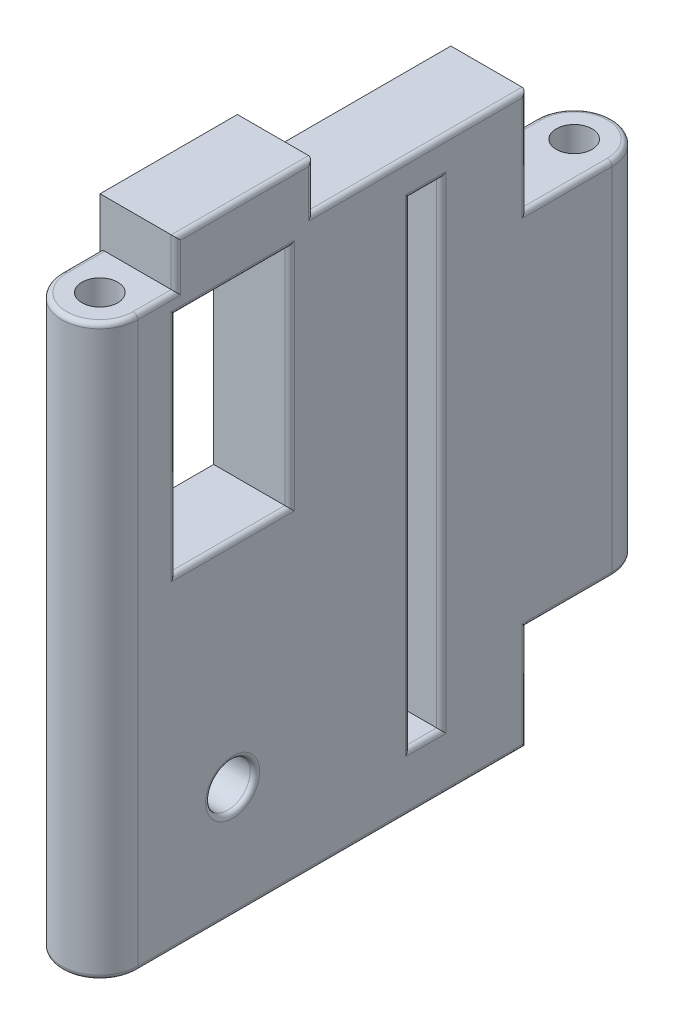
ISO-10303-21;
HEADER;
FILE_DESCRIPTION(('STEP AP214'),'2;1');
FILE_NAME('part.step','',(''),(''),'','','');
FILE_SCHEMA(('AUTOMOTIVE_DESIGN { 1 0 10303 214 1 1 1 1 }'));
ENDSEC;
DATA;
#1=APPLICATION_CONTEXT('core data for automotive mechanical design processes');
#2=APPLICATION_PROTOCOL_DEFINITION('international standard','automotive_design',2000,#1);
#3=PRODUCT_CONTEXT('',#1,'mechanical');
#4=PRODUCT('Part','Part','',(#3));
#5=PRODUCT_RELATED_PRODUCT_CATEGORY('part','',(#4));
#6=PRODUCT_DEFINITION_FORMATION('','',#4);
#7=PRODUCT_DEFINITION_CONTEXT('part definition',#1,'design');
#8=PRODUCT_DEFINITION('design','',#6,#7);
#9=PRODUCT_DEFINITION_SHAPE('','',#8);
#10=(LENGTH_UNIT() NAMED_UNIT(*) SI_UNIT(.MILLI.,.METRE.));
#11=(NAMED_UNIT(*) PLANE_ANGLE_UNIT() SI_UNIT($,.RADIAN.));
#12=(NAMED_UNIT(*) SI_UNIT($,.STERADIAN.) SOLID_ANGLE_UNIT());
#13=UNCERTAINTY_MEASURE_WITH_UNIT(LENGTH_MEASURE(1.E-05),#10,'distance_accuracy_value','');
#14=(GEOMETRIC_REPRESENTATION_CONTEXT(3) GLOBAL_UNCERTAINTY_ASSIGNED_CONTEXT((#13)) GLOBAL_UNIT_ASSIGNED_CONTEXT((#10,
#11,#12)) REPRESENTATION_CONTEXT('',''));
#15=CARTESIAN_POINT('',(0.,0.,0.));
#16=DIRECTION('',(0.,0.,1.));
#17=DIRECTION('',(1.,0.,0.));
#18=AXIS2_PLACEMENT_3D('',#15,#16,#17);
#19=CARTESIAN_POINT('',(0.,60.,0.));
#20=DIRECTION('',(0.,1.,0.));
#21=DIRECTION('',(0.,0.,1.));
#22=AXIS2_PLACEMENT_3D('',#19,#20,#21);
#23=PLANE('',#22);
#24=DIRECTION('',(1.,0.,0.));
#25=VECTOR('',#24,1.);
#26=CARTESIAN_POINT('',(-4.,60.,45.9755050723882));
#27=LINE('',#26,#25);
#28=CARTESIAN_POINT('',(-3.49999999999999,60.,45.9755050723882));
#29=VERTEX_POINT('',#28);
#30=CARTESIAN_POINT('',(3.5,60.,45.9755050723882));
#31=VERTEX_POINT('',#30);
#32=EDGE_CURVE('E297',#29,#31,#27,.T.);
#33=ORIENTED_EDGE('',*,*,#32,.F.);
#34=DIRECTION('',(0.,0.,1.));
#35=VECTOR('',#34,1.);
#36=CARTESIAN_POINT('',(-3.49999999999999,60.,50.));
#37=LINE('',#36,#35);
#38=CARTESIAN_POINT('',(-3.49999999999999,60.,50.));
#39=VERTEX_POINT('',#38);
#40=EDGE_CURVE('E620',#29,#39,#37,.T.);
#41=ORIENTED_EDGE('',*,*,#40,.T.);
#42=CARTESIAN_POINT('',(0.,60.,50.));
#43=DIRECTION('',(0.,1.,0.));
#44=DIRECTION('',(0.,0.,1.));
#45=AXIS2_PLACEMENT_3D('',#42,#43,#44);
#46=CIRCLE('',#45,3.5);
#47=CARTESIAN_POINT('',(3.50000000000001,60.,50.));
#48=VERTEX_POINT('',#47);
#49=EDGE_CURVE('E623',#39,#48,#46,.T.);
#50=ORIENTED_EDGE('',*,*,#49,.T.);
#51=DIRECTION('',(0.,0.,-1.));
#52=VECTOR('',#51,1.);
#53=CARTESIAN_POINT('',(3.5,60.,45.9755050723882));
#54=LINE('',#53,#52);
#55=EDGE_CURVE('E625',#48,#31,#54,.T.);
#56=ORIENTED_EDGE('',*,*,#55,.T.);
#57=EDGE_LOOP('',(#33,#41,#50,#56));
#58=FACE_BOUND('',#57,.T.);
#59=CARTESIAN_POINT('',(0.,60.,50.));
#60=DIRECTION('',(0.,-1.,0.));
#61=DIRECTION('',(0.,0.,-1.));
#62=AXIS2_PLACEMENT_3D('',#59,#60,#61);
#63=CIRCLE('',#62,1.8875);
#64=CARTESIAN_POINT('',(0.,60.,48.1125));
#65=VERTEX_POINT('',#64);
#66=EDGE_CURVE('E1126',#65,#65,#63,.T.);
#67=ORIENTED_EDGE('',*,*,#66,.T.);
#68=EDGE_LOOP('',(#67));
#69=FACE_BOUND('',#68,.T.);
#70=ADVANCED_FACE('F38',(#58,#69),#23,.T.);
#71=CARTESIAN_POINT('',(0.,60.,0.));
#72=DIRECTION('',(0.,-1.,0.));
#73=DIRECTION('',(0.,0.,-1.));
#74=AXIS2_PLACEMENT_3D('',#71,#72,#73);
#75=CYLINDRICAL_SURFACE('',#74,4.);
#76=DIRECTION('',(0.,-1.,0.));
#77=VECTOR('',#76,1.);
#78=CARTESIAN_POINT('',(-4.,60.,0.));
#79=LINE('',#78,#77);
#80=CARTESIAN_POINT('',(-4.,48.5,0.));
#81=VERTEX_POINT('',#80);
#82=CARTESIAN_POINT('',(-4.,11.5,0.));
#83=VERTEX_POINT('',#82);
#84=EDGE_CURVE('E509',#81,#83,#79,.T.);
#85=ORIENTED_EDGE('',*,*,#84,.F.);
#86=CARTESIAN_POINT('',(0.,48.5,0.));
#87=DIRECTION('',(0.,-1.,0.));
#88=DIRECTION('',(0.,0.,-1.));
#89=AXIS2_PLACEMENT_3D('',#86,#87,#88);
#90=CIRCLE('',#89,4.);
#91=CARTESIAN_POINT('',(4.,48.5,0.));
#92=VERTEX_POINT('',#91);
#93=EDGE_CURVE('E534',#81,#92,#90,.T.);
#94=ORIENTED_EDGE('',*,*,#93,.T.);
#95=DIRECTION('',(0.,-1.,0.));
#96=VECTOR('',#95,1.);
#97=CARTESIAN_POINT('',(4.,60.,0.));
#98=LINE('',#97,#96);
#99=CARTESIAN_POINT('',(4.,11.5,0.));
#100=VERTEX_POINT('',#99);
#101=EDGE_CURVE('E638',#92,#100,#98,.T.);
#102=ORIENTED_EDGE('',*,*,#101,.T.);
#103=CARTESIAN_POINT('',(0.,11.5,0.));
#104=DIRECTION('',(0.,1.,0.));
#105=DIRECTION('',(0.,0.,1.));
#106=AXIS2_PLACEMENT_3D('',#103,#104,#105);
#107=CIRCLE('',#106,4.);
#108=EDGE_CURVE('E532',#100,#83,#107,.T.);
#109=ORIENTED_EDGE('',*,*,#108,.T.);
#110=EDGE_LOOP('',(#85,#94,#102,#109));
#111=FACE_BOUND('',#110,.T.);
#112=ADVANCED_FACE('F569',(#111),#75,.T.);
#113=CARTESIAN_POINT('',(-4.,60.,0.));
#114=DIRECTION('',(1.,0.,0.));
#115=DIRECTION('',(0.,0.,-1.));
#116=AXIS2_PLACEMENT_3D('',#113,#114,#115);
#117=PLANE('',#116);
#118=DIRECTION('',(0.,0.,1.));
#119=VECTOR('',#118,1.);
#120=CARTESIAN_POINT('',(-4.,6.,18.));
#121=LINE('',#120,#119);
#122=CARTESIAN_POINT('',(-4.,6.,18.));
#123=VERTEX_POINT('',#122);
#124=CARTESIAN_POINT('',(-4.,6.,21.3));
#125=VERTEX_POINT('',#124);
#126=EDGE_CURVE('E274',#123,#125,#121,.T.);
#127=ORIENTED_EDGE('',*,*,#126,.F.);
#128=DIRECTION('',(0.,-1.,0.));
#129=VECTOR('',#128,1.);
#130=CARTESIAN_POINT('',(-4.,56.3,18.));
#131=LINE('',#130,#129);
#132=CARTESIAN_POINT('',(-4.,56.3,18.));
#133=VERTEX_POINT('',#132);
#134=EDGE_CURVE('E279',#133,#123,#131,.T.);
#135=ORIENTED_EDGE('',*,*,#134,.F.);
#136=DIRECTION('',(0.,0.,-1.));
#137=VECTOR('',#136,1.);
#138=CARTESIAN_POINT('',(-4.,56.3,18.));
#139=LINE('',#138,#137);
#140=CARTESIAN_POINT('',(-4.,56.3,21.3));
#141=VERTEX_POINT('',#140);
#142=EDGE_CURVE('E284',#141,#133,#139,.T.);
#143=ORIENTED_EDGE('',*,*,#142,.F.);
#144=DIRECTION('',(0.,1.,0.));
#145=VECTOR('',#144,1.);
#146=CARTESIAN_POINT('',(-4.,56.3,21.3));
#147=LINE('',#146,#145);
#148=EDGE_CURVE('E266',#125,#141,#147,.T.);
#149=ORIENTED_EDGE('',*,*,#148,.F.);
#150=EDGE_LOOP('',(#127,#135,#143,#149));
#151=FACE_BOUND('',#150,.T.);
#152=CARTESIAN_POINT('',(-4.,11.8464,40.));
#153=DIRECTION('',(-1.,0.,0.));
#154=DIRECTION('',(0.,0.,1.));
#155=AXIS2_PLACEMENT_3D('',#152,#153,#154);
#156=CIRCLE('',#155,2.35);
#157=CARTESIAN_POINT('',(-4.,11.8464,42.35));
#158=VERTEX_POINT('',#157);
#159=EDGE_CURVE('E1129',#158,#158,#156,.T.);
#160=ORIENTED_EDGE('',*,*,#159,.F.);
#161=EDGE_LOOP('',(#160));
#162=FACE_BOUND('',#161,.T.);
#163=DIRECTION('',(0.,0.,1.));
#164=VECTOR('',#163,1.);
#165=CARTESIAN_POINT('',(-4.,34.3,34.));
#166=LINE('',#165,#164);
#167=CARTESIAN_POINT('',(-4.,34.3,34.));
#168=VERTEX_POINT('',#167);
#169=CARTESIAN_POINT('',(-4.,34.3,46.));
#170=VERTEX_POINT('',#169);
#171=EDGE_CURVE('E1138',#168,#170,#166,.T.);
#172=ORIENTED_EDGE('',*,*,#171,.F.);
#173=DIRECTION('',(0.,-1.,0.));
#174=VECTOR('',#173,1.);
#175=CARTESIAN_POINT('',(-4.,34.3,34.));
#176=LINE('',#175,#174);
#177=CARTESIAN_POINT('',(-4.,58.,34.));
#178=VERTEX_POINT('',#177);
#179=EDGE_CURVE('E1135',#178,#168,#176,.T.);
#180=ORIENTED_EDGE('',*,*,#179,.F.);
#181=DIRECTION('',(0.,0.,-1.));
#182=VECTOR('',#181,1.);
#183=CARTESIAN_POINT('',(-4.,58.,34.));
#184=LINE('',#183,#182);
#185=CARTESIAN_POINT('',(-4.,58.,46.));
#186=VERTEX_POINT('',#185);
#187=EDGE_CURVE('E1144',#186,#178,#184,.T.);
#188=ORIENTED_EDGE('',*,*,#187,.F.);
#189=DIRECTION('',(0.,1.,0.));
#190=VECTOR('',#189,1.);
#191=CARTESIAN_POINT('',(-4.,34.3,46.));
#192=LINE('',#191,#190);
#193=EDGE_CURVE('E1141',#170,#186,#192,.T.);
#194=ORIENTED_EDGE('',*,*,#193,.F.);
#195=EDGE_LOOP('',(#172,#180,#188,#194));
#196=FACE_BOUND('',#195,.T.);
#197=DIRECTION('',(0.,-1.,0.));
#198=VECTOR('',#197,1.);
#199=CARTESIAN_POINT('',(-3.99999999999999,60.,50.));
#200=LINE('',#199,#198);
#201=CARTESIAN_POINT('',(-3.99999999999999,59.5,50.));
#202=VERTEX_POINT('',#201);
#203=CARTESIAN_POINT('',(-3.99999999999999,0.5,50.));
#204=VERTEX_POINT('',#203);
#205=EDGE_CURVE('E649',#202,#204,#200,.T.);
#206=ORIENTED_EDGE('',*,*,#205,.F.);
#207=DIRECTION('',(0.,0.,1.));
#208=VECTOR('',#207,1.);
#209=CARTESIAN_POINT('',(-3.99999999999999,59.5,45.9755050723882));
#210=LINE('',#209,#208);
#211=CARTESIAN_POINT('',(-4.,59.5,45.9755050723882));
#212=VERTEX_POINT('',#211);
#213=EDGE_CURVE('E609',#202,#212,#210,.F.);
#214=ORIENTED_EDGE('',*,*,#213,.T.);
#215=DIRECTION('',(0.,-1.,0.));
#216=VECTOR('',#215,1.);
#217=CARTESIAN_POINT('',(-4.,65.,45.9755050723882));
#218=LINE('',#217,#216);
#219=CARTESIAN_POINT('',(-4.,65.,45.9755050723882));
#220=VERTEX_POINT('',#219);
#221=EDGE_CURVE('E302',#220,#212,#218,.T.);
#222=ORIENTED_EDGE('',*,*,#221,.F.);
#223=DIRECTION('',(0.,0.,1.));
#224=VECTOR('',#223,1.);
#225=CARTESIAN_POINT('',(-4.,65.,31.5));
#226=LINE('',#225,#224);
#227=CARTESIAN_POINT('',(-4.,65.,31.5));
#228=VERTEX_POINT('',#227);
#229=EDGE_CURVE('E296',#228,#220,#226,.T.);
#230=ORIENTED_EDGE('',*,*,#229,.F.);
#231=DIRECTION('',(0.,-1.,0.));
#232=VECTOR('',#231,1.);
#233=CARTESIAN_POINT('',(-4.,65.,31.5));
#234=LINE('',#233,#232);
#235=CARTESIAN_POINT('',(-4.,60.,31.5));
#236=VERTEX_POINT('',#235);
#237=EDGE_CURVE('E476',#228,#236,#234,.T.);
#238=ORIENTED_EDGE('',*,*,#237,.T.);
#239=DIRECTION('',(0.,0.,1.));
#240=VECTOR('',#239,1.);
#241=CARTESIAN_POINT('',(-4.,60.,0.));
#242=LINE('',#241,#240);
#243=CARTESIAN_POINT('',(-4.,60.,8.99999999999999));
#244=VERTEX_POINT('',#243);
#245=EDGE_CURVE('E635',#244,#236,#242,.T.);
#246=ORIENTED_EDGE('',*,*,#245,.F.);
#247=DIRECTION('',(0.,1.,0.));
#248=VECTOR('',#247,1.);
#249=CARTESIAN_POINT('',(-4.,49.,8.99999999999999));
#250=LINE('',#249,#248);
#251=CARTESIAN_POINT('',(-4.,48.5,8.99999999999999));
#252=VERTEX_POINT('',#251);
#253=EDGE_CURVE('E507',#252,#244,#250,.T.);
#254=ORIENTED_EDGE('',*,*,#253,.F.);
#255=DIRECTION('',(0.,0.,1.));
#256=VECTOR('',#255,1.);
#257=CARTESIAN_POINT('',(-4.,48.5,0.));
#258=LINE('',#257,#256);
#259=EDGE_CURVE('E611',#252,#81,#258,.F.);
#260=ORIENTED_EDGE('',*,*,#259,.T.);
#261=ORIENTED_EDGE('',*,*,#84,.T.);
#262=DIRECTION('',(0.,0.,-1.));
#263=VECTOR('',#262,1.);
#264=CARTESIAN_POINT('',(-4.,11.5,0.));
#265=LINE('',#264,#263);
#266=CARTESIAN_POINT('',(-4.,11.5,9.));
#267=VERTEX_POINT('',#266);
#268=EDGE_CURVE('E615',#83,#267,#265,.F.);
#269=ORIENTED_EDGE('',*,*,#268,.T.);
#270=DIRECTION('',(0.,1.,0.));
#271=VECTOR('',#270,1.);
#272=CARTESIAN_POINT('',(-4.,11.,9.));
#273=LINE('',#272,#271);
#274=CARTESIAN_POINT('',(-4.,0.5,9.));
#275=VERTEX_POINT('',#274);
#276=EDGE_CURVE('E682',#275,#267,#273,.T.);
#277=ORIENTED_EDGE('',*,*,#276,.F.);
#278=DIRECTION('',(0.,0.,1.));
#279=VECTOR('',#278,1.);
#280=CARTESIAN_POINT('',(-4.,0.5,0.));
#281=LINE('',#280,#279);
#282=EDGE_CURVE('E618',#275,#204,#281,.T.);
#283=ORIENTED_EDGE('',*,*,#282,.T.);
#284=EDGE_LOOP('',(#206,#214,#222,#230,#238,#246,#254,#260,#261,#269,#277,#283));
#285=FACE_BOUND('',#284,.T.);
#286=ADVANCED_FACE('F281',(#151,#162,#196,#285),#117,.F.);
#287=CARTESIAN_POINT('',(0.,60.,50.));
#288=DIRECTION('',(0.,-1.,0.));
#289=DIRECTION('',(0.,0.,-1.));
#290=AXIS2_PLACEMENT_3D('',#287,#288,#289);
#291=CYLINDRICAL_SURFACE('',#290,4.);
#292=DIRECTION('',(0.,-1.,0.));
#293=VECTOR('',#292,1.);
#294=CARTESIAN_POINT('',(4.00000000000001,60.,50.));
#295=LINE('',#294,#293);
#296=CARTESIAN_POINT('',(4.00000000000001,59.5,50.));
#297=VERTEX_POINT('',#296);
#298=CARTESIAN_POINT('',(4.00000000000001,0.5,50.));
#299=VERTEX_POINT('',#298);
#300=EDGE_CURVE('E647',#297,#299,#295,.T.);
#301=ORIENTED_EDGE('',*,*,#300,.F.);
#302=CARTESIAN_POINT('',(0.,59.5,50.));
#303=DIRECTION('',(0.,1.,0.));
#304=DIRECTION('',(0.,0.,1.));
#305=AXIS2_PLACEMENT_3D('',#302,#303,#304);
#306=CIRCLE('',#305,4.);
#307=EDGE_CURVE('E523',#297,#202,#306,.F.);
#308=ORIENTED_EDGE('',*,*,#307,.T.);
#309=ORIENTED_EDGE('',*,*,#205,.T.);
#310=CARTESIAN_POINT('',(0.,0.5,50.));
#311=DIRECTION('',(0.,1.,0.));
#312=DIRECTION('',(0.,0.,1.));
#313=AXIS2_PLACEMENT_3D('',#310,#311,#312);
#314=CIRCLE('',#313,4.);
#315=EDGE_CURVE('E527',#204,#299,#314,.T.);
#316=ORIENTED_EDGE('',*,*,#315,.T.);
#317=EDGE_LOOP('',(#301,#308,#309,#316));
#318=FACE_BOUND('',#317,.T.);
#319=ADVANCED_FACE('F555',(#318),#291,.T.);
#320=CARTESIAN_POINT('',(4.,60.,0.));
#321=DIRECTION('',(-1.,0.,0.));
#322=DIRECTION('',(0.,0.,1.));
#323=AXIS2_PLACEMENT_3D('',#320,#321,#322);
#324=PLANE('',#323);
#325=DIRECTION('',(0.,0.,1.));
#326=VECTOR('',#325,1.);
#327=CARTESIAN_POINT('',(4.,33.8,0.));
#328=LINE('',#327,#326);
#329=CARTESIAN_POINT('',(4.,33.8,33.5));
#330=VERTEX_POINT('',#329);
#331=CARTESIAN_POINT('',(4.00000000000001,33.8,46.5));
#332=VERTEX_POINT('',#331);
#333=EDGE_CURVE('E435',#330,#332,#328,.T.);
#334=ORIENTED_EDGE('',*,*,#333,.T.);
#335=DIRECTION('',(0.,1.,0.));
#336=VECTOR('',#335,1.);
#337=CARTESIAN_POINT('',(4.00000000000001,60.,46.5));
#338=LINE('',#337,#336);
#339=CARTESIAN_POINT('',(4.00000000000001,58.5,46.5));
#340=VERTEX_POINT('',#339);
#341=EDGE_CURVE('E437',#332,#340,#338,.T.);
#342=ORIENTED_EDGE('',*,*,#341,.T.);
#343=DIRECTION('',(0.,0.,-1.));
#344=VECTOR('',#343,1.);
#345=CARTESIAN_POINT('',(4.,58.5,0.));
#346=LINE('',#345,#344);
#347=CARTESIAN_POINT('',(4.,58.5,33.5));
#348=VERTEX_POINT('',#347);
#349=EDGE_CURVE('E427',#340,#348,#346,.T.);
#350=ORIENTED_EDGE('',*,*,#349,.T.);
#351=DIRECTION('',(0.,-1.,0.));
#352=VECTOR('',#351,1.);
#353=CARTESIAN_POINT('',(4.,60.,33.5));
#354=LINE('',#353,#352);
#355=EDGE_CURVE('E433',#348,#330,#354,.T.);
#356=ORIENTED_EDGE('',*,*,#355,.T.);
#357=EDGE_LOOP('',(#334,#342,#350,#356));
#358=FACE_BOUND('',#357,.T.);
#359=CARTESIAN_POINT('',(4.,11.8464,40.));
#360=DIRECTION('',(-1.,0.,0.));
#361=DIRECTION('',(0.,0.,1.));
#362=AXIS2_PLACEMENT_3D('',#359,#360,#361);
#363=CIRCLE('',#362,2.85);
#364=CARTESIAN_POINT('',(4.,11.8464,42.85));
#365=VERTEX_POINT('',#364);
#366=EDGE_CURVE('E424',#365,#365,#363,.T.);
#367=ORIENTED_EDGE('',*,*,#366,.T.);
#368=EDGE_LOOP('',(#367));
#369=FACE_BOUND('',#368,.T.);
#370=DIRECTION('',(0.,0.,1.));
#371=VECTOR('',#370,1.);
#372=CARTESIAN_POINT('',(4.,5.5,0.));
#373=LINE('',#372,#371);
#374=CARTESIAN_POINT('',(4.,5.5,17.5));
#375=VERTEX_POINT('',#374);
#376=CARTESIAN_POINT('',(4.,5.5,21.8));
#377=VERTEX_POINT('',#376);
#378=EDGE_CURVE('E410',#375,#377,#373,.T.);
#379=ORIENTED_EDGE('',*,*,#378,.T.);
#380=DIRECTION('',(0.,1.,0.));
#381=VECTOR('',#380,1.);
#382=CARTESIAN_POINT('',(4.,60.,21.8));
#383=LINE('',#382,#381);
#384=CARTESIAN_POINT('',(4.,56.8,21.8));
#385=VERTEX_POINT('',#384);
#386=EDGE_CURVE('E422',#377,#385,#383,.T.);
#387=ORIENTED_EDGE('',*,*,#386,.T.);
#388=DIRECTION('',(0.,0.,-1.));
#389=VECTOR('',#388,1.);
#390=CARTESIAN_POINT('',(4.,56.8,0.));
#391=LINE('',#390,#389);
#392=CARTESIAN_POINT('',(4.,56.8,17.5));
#393=VERTEX_POINT('',#392);
#394=EDGE_CURVE('E553',#385,#393,#391,.T.);
#395=ORIENTED_EDGE('',*,*,#394,.T.);
#396=DIRECTION('',(0.,-1.,0.));
#397=VECTOR('',#396,1.);
#398=CARTESIAN_POINT('',(4.,60.,17.5));
#399=LINE('',#398,#397);
#400=EDGE_CURVE('E413',#393,#375,#399,.T.);
#401=ORIENTED_EDGE('',*,*,#400,.T.);
#402=EDGE_LOOP('',(#379,#387,#395,#401));
#403=FACE_BOUND('',#402,.T.);
#404=DIRECTION('',(0.,-1.,0.));
#405=VECTOR('',#404,1.);
#406=CARTESIAN_POINT('',(4.,60.,45.4755050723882));
#407=LINE('',#406,#405);
#408=CARTESIAN_POINT('',(4.,64.5,45.4755050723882));
#409=VERTEX_POINT('',#408);
#410=CARTESIAN_POINT('',(4.,59.5,45.4755050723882));
#411=VERTEX_POINT('',#410);
#412=EDGE_CURVE('E456',#409,#411,#407,.T.);
#413=ORIENTED_EDGE('',*,*,#412,.T.);
#414=DIRECTION('',(0.,0.,-1.));
#415=VECTOR('',#414,1.);
#416=CARTESIAN_POINT('',(4.00000000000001,59.5,50.));
#417=LINE('',#416,#415);
#418=EDGE_CURVE('E458',#411,#297,#417,.F.);
#419=ORIENTED_EDGE('',*,*,#418,.T.);
#420=ORIENTED_EDGE('',*,*,#300,.T.);
#421=DIRECTION('',(0.,0.,-1.));
#422=VECTOR('',#421,1.);
#423=CARTESIAN_POINT('',(4.,0.5,0.));
#424=LINE('',#423,#422);
#425=CARTESIAN_POINT('',(4.,0.5,9.5));
#426=VERTEX_POINT('',#425);
#427=EDGE_CURVE('E440',#299,#426,#424,.T.);
#428=ORIENTED_EDGE('',*,*,#427,.T.);
#429=DIRECTION('',(0.,1.,0.));
#430=VECTOR('',#429,1.);
#431=CARTESIAN_POINT('',(4.,60.,9.49999999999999));
#432=LINE('',#431,#430);
#433=CARTESIAN_POINT('',(4.,11.5,9.5));
#434=VERTEX_POINT('',#433);
#435=EDGE_CURVE('E442',#426,#434,#432,.T.);
#436=ORIENTED_EDGE('',*,*,#435,.T.);
#437=DIRECTION('',(0.,0.,-1.));
#438=VECTOR('',#437,1.);
#439=CARTESIAN_POINT('',(4.,11.5,0.));
#440=LINE('',#439,#438);
#441=EDGE_CURVE('E444',#434,#100,#440,.T.);
#442=ORIENTED_EDGE('',*,*,#441,.T.);
#443=ORIENTED_EDGE('',*,*,#101,.F.);
#444=DIRECTION('',(0.,0.,1.));
#445=VECTOR('',#444,1.);
#446=CARTESIAN_POINT('',(4.,48.5,0.));
#447=LINE('',#446,#445);
#448=CARTESIAN_POINT('',(4.,48.5,9.49999999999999));
#449=VERTEX_POINT('',#448);
#450=EDGE_CURVE('E446',#92,#449,#447,.T.);
#451=ORIENTED_EDGE('',*,*,#450,.T.);
#452=DIRECTION('',(0.,1.,0.));
#453=VECTOR('',#452,1.);
#454=CARTESIAN_POINT('',(4.,60.,9.49999999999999));
#455=LINE('',#454,#453);
#456=CARTESIAN_POINT('',(4.,59.5,9.49999999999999));
#457=VERTEX_POINT('',#456);
#458=EDGE_CURVE('E448',#449,#457,#455,.T.);
#459=ORIENTED_EDGE('',*,*,#458,.T.);
#460=DIRECTION('',(0.,0.,-1.));
#461=VECTOR('',#460,1.);
#462=CARTESIAN_POINT('',(4.,59.5,31.5));
#463=LINE('',#462,#461);
#464=CARTESIAN_POINT('',(4.,59.5,32.));
#465=VERTEX_POINT('',#464);
#466=EDGE_CURVE('E450',#457,#465,#463,.F.);
#467=ORIENTED_EDGE('',*,*,#466,.T.);
#468=DIRECTION('',(0.,-1.,0.));
#469=VECTOR('',#468,1.);
#470=CARTESIAN_POINT('',(4.,60.,32.));
#471=LINE('',#470,#469);
#472=CARTESIAN_POINT('',(4.,64.5,32.));
#473=VERTEX_POINT('',#472);
#474=EDGE_CURVE('E452',#465,#473,#471,.F.);
#475=ORIENTED_EDGE('',*,*,#474,.T.);
#476=DIRECTION('',(0.,0.,-1.));
#477=VECTOR('',#476,1.);
#478=CARTESIAN_POINT('',(4.00000000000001,64.5,45.9755050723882));
#479=LINE('',#478,#477);
#480=EDGE_CURVE('E454',#473,#409,#479,.F.);
#481=ORIENTED_EDGE('',*,*,#480,.T.);
#482=EDGE_LOOP('',(#413,#419,#420,#428,#436,#442,#443,#451,#459,#467,#475,#481));
#483=FACE_BOUND('',#482,.T.);
#484=ADVANCED_FACE('F487',(#358,#369,#403,#483),#324,.F.);
#485=DIRECTION('',(-1.,0.,0.));
#486=VECTOR('',#485,1.);
#487=CARTESIAN_POINT('',(4.,60.,31.5));
#488=LINE('',#487,#486);
#489=CARTESIAN_POINT('',(3.5,60.,31.5));
#490=VERTEX_POINT('',#489);
#491=EDGE_CURVE('E291',#490,#236,#488,.T.);
#492=ORIENTED_EDGE('',*,*,#491,.F.);
#493=DIRECTION('',(0.,0.,-1.));
#494=VECTOR('',#493,1.);
#495=CARTESIAN_POINT('',(3.5,60.,8.99999999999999));
#496=LINE('',#495,#494);
#497=CARTESIAN_POINT('',(3.5,60.,8.99999999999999));
#498=VERTEX_POINT('',#497);
#499=EDGE_CURVE('E314',#490,#498,#496,.T.);
#500=ORIENTED_EDGE('',*,*,#499,.T.);
#501=DIRECTION('',(1.,0.,0.));
#502=VECTOR('',#501,1.);
#503=CARTESIAN_POINT('',(0.,60.,8.99999999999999));
#504=LINE('',#503,#502);
#505=EDGE_CURVE('E500',#244,#498,#504,.T.);
#506=ORIENTED_EDGE('',*,*,#505,.F.);
#507=ORIENTED_EDGE('',*,*,#245,.T.);
#508=EDGE_LOOP('',(#492,#500,#506,#507));
#509=FACE_BOUND('',#508,.T.);
#510=ADVANCED_FACE('F498',(#509),#23,.T.);
#511=CARTESIAN_POINT('',(0.,0.,0.));
#512=DIRECTION('',(0.,1.,0.));
#513=DIRECTION('',(0.,0.,1.));
#514=AXIS2_PLACEMENT_3D('',#511,#512,#513);
#515=PLANE('',#514);
#516=CARTESIAN_POINT('',(0.,0.,50.));
#517=DIRECTION('',(0.,-1.,0.));
#518=DIRECTION('',(0.,0.,-1.));
#519=AXIS2_PLACEMENT_3D('',#516,#517,#518);
#520=CIRCLE('',#519,1.8875);
#521=CARTESIAN_POINT('',(0.,0.,48.1125));
#522=VERTEX_POINT('',#521);
#523=EDGE_CURVE('E590',#522,#522,#520,.T.);
#524=ORIENTED_EDGE('',*,*,#523,.F.);
#525=EDGE_LOOP('',(#524));
#526=FACE_BOUND('',#525,.T.);
#527=CARTESIAN_POINT('',(0.,0.,50.));
#528=DIRECTION('',(0.,1.,0.));
#529=DIRECTION('',(0.,0.,1.));
#530=AXIS2_PLACEMENT_3D('',#527,#528,#529);
#531=CIRCLE('',#530,3.5);
#532=CARTESIAN_POINT('',(3.50000000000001,0.,50.));
#533=VERTEX_POINT('',#532);
#534=CARTESIAN_POINT('',(-3.49999999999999,0.,50.));
#535=VERTEX_POINT('',#534);
#536=EDGE_CURVE('E545',#533,#535,#531,.F.);
#537=ORIENTED_EDGE('',*,*,#536,.T.);
#538=DIRECTION('',(0.,0.,1.));
#539=VECTOR('',#538,1.);
#540=CARTESIAN_POINT('',(-3.5,0.,0.));
#541=LINE('',#540,#539);
#542=CARTESIAN_POINT('',(-3.5,0.,9.));
#543=VERTEX_POINT('',#542);
#544=EDGE_CURVE('E547',#535,#543,#541,.F.);
#545=ORIENTED_EDGE('',*,*,#544,.T.);
#546=DIRECTION('',(1.,0.,0.));
#547=VECTOR('',#546,1.);
#548=CARTESIAN_POINT('',(0.,0.,9.));
#549=LINE('',#548,#547);
#550=CARTESIAN_POINT('',(3.5,0.,9.));
#551=VERTEX_POINT('',#550);
#552=EDGE_CURVE('E508',#543,#551,#549,.T.);
#553=ORIENTED_EDGE('',*,*,#552,.T.);
#554=DIRECTION('',(0.,0.,-1.));
#555=VECTOR('',#554,1.);
#556=CARTESIAN_POINT('',(3.5,0.,0.));
#557=LINE('',#556,#555);
#558=EDGE_CURVE('E543',#551,#533,#557,.F.);
#559=ORIENTED_EDGE('',*,*,#558,.T.);
#560=EDGE_LOOP('',(#537,#545,#553,#559));
#561=FACE_BOUND('',#560,.T.);
#562=ADVANCED_FACE('F562',(#526,#561),#515,.F.);
#563=CARTESIAN_POINT('',(46.,49.,-13.1258902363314));
#564=DIRECTION('',(0.,-1.,0.));
#565=DIRECTION('',(0.,0.,-1.));
#566=AXIS2_PLACEMENT_3D('',#563,#564,#565);
#567=PLANE('',#566);
#568=CARTESIAN_POINT('',(0.,49.,0.));
#569=DIRECTION('',(0.,-1.,0.));
#570=DIRECTION('',(0.,0.,-1.));
#571=AXIS2_PLACEMENT_3D('',#568,#569,#570);
#572=CIRCLE('',#571,1.8875);
#573=CARTESIAN_POINT('',(0.,49.,-1.8875));
#574=VERTEX_POINT('',#573);
#575=EDGE_CURVE('E1127',#574,#574,#572,.T.);
#576=ORIENTED_EDGE('',*,*,#575,.T.);
#577=EDGE_LOOP('',(#576));
#578=FACE_BOUND('',#577,.T.);
#579=CARTESIAN_POINT('',(0.,49.,0.));
#580=DIRECTION('',(0.,-1.,0.));
#581=DIRECTION('',(0.,0.,-1.));
#582=AXIS2_PLACEMENT_3D('',#579,#580,#581);
#583=CIRCLE('',#582,3.5);
#584=CARTESIAN_POINT('',(3.5,49.,0.));
#585=VERTEX_POINT('',#584);
#586=CARTESIAN_POINT('',(-3.5,49.,0.));
#587=VERTEX_POINT('',#586);
#588=EDGE_CURVE('E522',#585,#587,#583,.F.);
#589=ORIENTED_EDGE('',*,*,#588,.T.);
#590=DIRECTION('',(0.,0.,1.));
#591=VECTOR('',#590,1.);
#592=CARTESIAN_POINT('',(-3.5,49.,-13.1258902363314));
#593=LINE('',#592,#591);
#594=CARTESIAN_POINT('',(-3.5,49.,8.99999999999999));
#595=VERTEX_POINT('',#594);
#596=EDGE_CURVE('E525',#587,#595,#593,.T.);
#597=ORIENTED_EDGE('',*,*,#596,.T.);
#598=DIRECTION('',(-1.,0.,0.));
#599=VECTOR('',#598,1.);
#600=CARTESIAN_POINT('',(46.,49.,8.99999999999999));
#601=LINE('',#600,#599);
#602=CARTESIAN_POINT('',(3.5,49.,8.99999999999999));
#603=VERTEX_POINT('',#602);
#604=EDGE_CURVE('E639',#603,#595,#601,.T.);
#605=ORIENTED_EDGE('',*,*,#604,.F.);
#606=DIRECTION('',(0.,0.,1.));
#607=VECTOR('',#606,1.);
#608=CARTESIAN_POINT('',(3.5,49.,-13.1258902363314));
#609=LINE('',#608,#607);
#610=EDGE_CURVE('E518',#603,#585,#609,.F.);
#611=ORIENTED_EDGE('',*,*,#610,.T.);
#612=EDGE_LOOP('',(#589,#597,#605,#611));
#613=FACE_BOUND('',#612,.T.);
#614=ADVANCED_FACE('F579',(#578,#613),#567,.F.);
#615=CARTESIAN_POINT('',(46.,49.,8.99999999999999));
#616=DIRECTION('',(0.,0.,1.));
#617=DIRECTION('',(1.,0.,0.));
#618=AXIS2_PLACEMENT_3D('',#615,#616,#617);
#619=PLANE('',#618);
#620=ORIENTED_EDGE('',*,*,#505,.T.);
#621=DIRECTION('',(0.,1.,0.));
#622=VECTOR('',#621,1.);
#623=CARTESIAN_POINT('',(3.5,49.,8.99999999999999));
#624=LINE('',#623,#622);
#625=EDGE_CURVE('E316',#498,#603,#624,.F.);
#626=ORIENTED_EDGE('',*,*,#625,.T.);
#627=ORIENTED_EDGE('',*,*,#604,.T.);
#628=CARTESIAN_POINT('',(-3.5,48.5,8.99999999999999));
#629=DIRECTION('',(0.,0.,1.));
#630=DIRECTION('',(1.,0.,0.));
#631=AXIS2_PLACEMENT_3D('',#628,#629,#630);
#632=CIRCLE('',#631,0.5);
#633=EDGE_CURVE('E47',#595,#252,#632,.T.);
#634=ORIENTED_EDGE('',*,*,#633,.T.);
#635=ORIENTED_EDGE('',*,*,#253,.T.);
#636=EDGE_LOOP('',(#620,#626,#627,#634,#635));
#637=FACE_BOUND('',#636,.T.);
#638=ADVANCED_FACE('F504',(#637),#619,.F.);
#639=CARTESIAN_POINT('',(46.,11.,-13.1258902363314));
#640=DIRECTION('',(0.,1.,0.));
#641=DIRECTION('',(0.,0.,1.));
#642=AXIS2_PLACEMENT_3D('',#639,#640,#641);
#643=PLANE('',#642);
#644=CARTESIAN_POINT('',(0.,11.,0.));
#645=DIRECTION('',(0.,1.,0.));
#646=DIRECTION('',(0.,0.,1.));
#647=AXIS2_PLACEMENT_3D('',#644,#645,#646);
#648=CIRCLE('',#647,1.8875);
#649=CARTESIAN_POINT('',(0.,11.,1.8875));
#650=VERTEX_POINT('',#649);
#651=EDGE_CURVE('E634',#650,#650,#648,.T.);
#652=ORIENTED_EDGE('',*,*,#651,.T.);
#653=EDGE_LOOP('',(#652));
#654=FACE_BOUND('',#653,.T.);
#655=DIRECTION('',(-1.,0.,0.));
#656=VECTOR('',#655,1.);
#657=CARTESIAN_POINT('',(46.,11.,9.));
#658=LINE('',#657,#656);
#659=CARTESIAN_POINT('',(3.5,11.,9.));
#660=VERTEX_POINT('',#659);
#661=CARTESIAN_POINT('',(-3.5,11.,9.));
#662=VERTEX_POINT('',#661);
#663=EDGE_CURVE('E685',#660,#662,#658,.T.);
#664=ORIENTED_EDGE('',*,*,#663,.T.);
#665=DIRECTION('',(0.,0.,-1.));
#666=VECTOR('',#665,1.);
#667=CARTESIAN_POINT('',(-3.5,11.,-13.1258902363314));
#668=LINE('',#667,#666);
#669=CARTESIAN_POINT('',(-3.5,11.,0.));
#670=VERTEX_POINT('',#669);
#671=EDGE_CURVE('E540',#662,#670,#668,.T.);
#672=ORIENTED_EDGE('',*,*,#671,.T.);
#673=CARTESIAN_POINT('',(0.,11.,0.));
#674=DIRECTION('',(0.,1.,0.));
#675=DIRECTION('',(0.,0.,1.));
#676=AXIS2_PLACEMENT_3D('',#673,#674,#675);
#677=CIRCLE('',#676,3.5);
#678=CARTESIAN_POINT('',(3.5,11.,0.));
#679=VERTEX_POINT('',#678);
#680=EDGE_CURVE('E538',#670,#679,#677,.F.);
#681=ORIENTED_EDGE('',*,*,#680,.T.);
#682=DIRECTION('',(0.,0.,-1.));
#683=VECTOR('',#682,1.);
#684=CARTESIAN_POINT('',(3.5,11.,-13.1258902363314));
#685=LINE('',#684,#683);
#686=EDGE_CURVE('E536',#679,#660,#685,.F.);
#687=ORIENTED_EDGE('',*,*,#686,.T.);
#688=EDGE_LOOP('',(#664,#672,#681,#687));
#689=FACE_BOUND('',#688,.T.);
#690=ADVANCED_FACE('F715',(#654,#689),#643,.F.);
#691=CARTESIAN_POINT('',(46.,11.,9.));
#692=DIRECTION('',(0.,0.,1.));
#693=DIRECTION('',(0.,-1.,0.));
#694=AXIS2_PLACEMENT_3D('',#691,#692,#693);
#695=PLANE('',#694);
#696=ORIENTED_EDGE('',*,*,#552,.F.);
#697=CARTESIAN_POINT('',(-3.5,0.5,9.));
#698=DIRECTION('',(0.,0.,1.));
#699=DIRECTION('',(0.,-1.,0.));
#700=AXIS2_PLACEMENT_3D('',#697,#698,#699);
#701=CIRCLE('',#700,0.5);
#702=EDGE_CURVE('E551',#543,#275,#701,.F.);
#703=ORIENTED_EDGE('',*,*,#702,.T.);
#704=ORIENTED_EDGE('',*,*,#276,.T.);
#705=CARTESIAN_POINT('',(-3.5,11.5,9.));
#706=DIRECTION('',(0.,0.,1.));
#707=DIRECTION('',(0.,-1.,0.));
#708=AXIS2_PLACEMENT_3D('',#705,#706,#707);
#709=CIRCLE('',#708,0.5);
#710=EDGE_CURVE('E12',#267,#662,#709,.T.);
#711=ORIENTED_EDGE('',*,*,#710,.T.);
#712=ORIENTED_EDGE('',*,*,#663,.F.);
#713=DIRECTION('',(0.,1.,0.));
#714=VECTOR('',#713,1.);
#715=CARTESIAN_POINT('',(3.5,11.,9.));
#716=LINE('',#715,#714);
#717=EDGE_CURVE('E549',#660,#551,#716,.F.);
#718=ORIENTED_EDGE('',*,*,#717,.T.);
#719=EDGE_LOOP('',(#696,#703,#704,#711,#712,#718));
#720=FACE_BOUND('',#719,.T.);
#721=ADVANCED_FACE('F713',(#720),#695,.F.);
#722=CARTESIAN_POINT('',(46.,34.3,34.));
#723=DIRECTION('',(0.,0.,-1.));
#724=DIRECTION('',(-1.,0.,0.));
#725=AXIS2_PLACEMENT_3D('',#722,#723,#724);
#726=PLANE('',#725);
#727=DIRECTION('',(-1.,0.,0.));
#728=VECTOR('',#727,1.);
#729=CARTESIAN_POINT('',(46.,34.3,34.));
#730=LINE('',#729,#728);
#731=CARTESIAN_POINT('',(3.5,34.3,34.));
#732=VERTEX_POINT('',#731);
#733=EDGE_CURVE('E693',#732,#168,#730,.T.);
#734=ORIENTED_EDGE('',*,*,#733,.F.);
#735=DIRECTION('',(0.,-1.,0.));
#736=VECTOR('',#735,1.);
#737=CARTESIAN_POINT('',(3.5,34.3,34.));
#738=LINE('',#737,#736);
#739=CARTESIAN_POINT('',(3.5,58.,34.));
#740=VERTEX_POINT('',#739);
#741=EDGE_CURVE('E323',#732,#740,#738,.F.);
#742=ORIENTED_EDGE('',*,*,#741,.T.);
#743=DIRECTION('',(-1.,0.,0.));
#744=VECTOR('',#743,1.);
#745=CARTESIAN_POINT('',(46.,58.,34.));
#746=LINE('',#745,#744);
#747=EDGE_CURVE('E686',#740,#178,#746,.T.);
#748=ORIENTED_EDGE('',*,*,#747,.T.);
#749=ORIENTED_EDGE('',*,*,#179,.T.);
#750=EDGE_LOOP('',(#734,#742,#748,#749));
#751=FACE_BOUND('',#750,.T.);
#752=ADVANCED_FACE('F1017',(#751),#726,.F.);
#753=CARTESIAN_POINT('',(46.,58.,34.));
#754=DIRECTION('',(0.,1.,0.));
#755=DIRECTION('',(0.,0.,1.));
#756=AXIS2_PLACEMENT_3D('',#753,#754,#755);
#757=PLANE('',#756);
#758=ORIENTED_EDGE('',*,*,#747,.F.);
#759=DIRECTION('',(0.,0.,-1.));
#760=VECTOR('',#759,1.);
#761=CARTESIAN_POINT('',(3.5,58.,34.));
#762=LINE('',#761,#760);
#763=CARTESIAN_POINT('',(3.5,58.,46.));
#764=VERTEX_POINT('',#763);
#765=EDGE_CURVE('E325',#740,#764,#762,.F.);
#766=ORIENTED_EDGE('',*,*,#765,.T.);
#767=DIRECTION('',(-1.,0.,0.));
#768=VECTOR('',#767,1.);
#769=CARTESIAN_POINT('',(46.,58.,46.));
#770=LINE('',#769,#768);
#771=EDGE_CURVE('E690',#764,#186,#770,.T.);
#772=ORIENTED_EDGE('',*,*,#771,.T.);
#773=ORIENTED_EDGE('',*,*,#187,.T.);
#774=EDGE_LOOP('',(#758,#766,#772,#773));
#775=FACE_BOUND('',#774,.T.);
#776=ADVANCED_FACE('F1007',(#775),#757,.F.);
#777=CARTESIAN_POINT('',(46.,34.3,46.));
#778=DIRECTION('',(0.,0.,1.));
#779=DIRECTION('',(1.,0.,0.));
#780=AXIS2_PLACEMENT_3D('',#777,#778,#779);
#781=PLANE('',#780);
#782=ORIENTED_EDGE('',*,*,#771,.F.);
#783=DIRECTION('',(0.,1.,0.));
#784=VECTOR('',#783,1.);
#785=CARTESIAN_POINT('',(3.5,34.3,46.));
#786=LINE('',#785,#784);
#787=CARTESIAN_POINT('',(3.5,34.3,46.));
#788=VERTEX_POINT('',#787);
#789=EDGE_CURVE('E318',#764,#788,#786,.F.);
#790=ORIENTED_EDGE('',*,*,#789,.T.);
#791=DIRECTION('',(-1.,0.,0.));
#792=VECTOR('',#791,1.);
#793=CARTESIAN_POINT('',(46.,34.3,46.));
#794=LINE('',#793,#792);
#795=EDGE_CURVE('E1147',#788,#170,#794,.T.);
#796=ORIENTED_EDGE('',*,*,#795,.T.);
#797=ORIENTED_EDGE('',*,*,#193,.T.);
#798=EDGE_LOOP('',(#782,#790,#796,#797));
#799=FACE_BOUND('',#798,.T.);
#800=ADVANCED_FACE('F997',(#799),#781,.F.);
#801=CARTESIAN_POINT('',(46.,34.3,34.));
#802=DIRECTION('',(0.,-1.,0.));
#803=DIRECTION('',(0.,0.,-1.));
#804=AXIS2_PLACEMENT_3D('',#801,#802,#803);
#805=PLANE('',#804);
#806=ORIENTED_EDGE('',*,*,#795,.F.);
#807=DIRECTION('',(0.,0.,1.));
#808=VECTOR('',#807,1.);
#809=CARTESIAN_POINT('',(3.5,34.3,34.));
#810=LINE('',#809,#808);
#811=EDGE_CURVE('E321',#788,#732,#810,.F.);
#812=ORIENTED_EDGE('',*,*,#811,.T.);
#813=ORIENTED_EDGE('',*,*,#733,.T.);
#814=ORIENTED_EDGE('',*,*,#171,.T.);
#815=EDGE_LOOP('',(#806,#812,#813,#814));
#816=FACE_BOUND('',#815,.T.);
#817=ADVANCED_FACE('F985',(#816),#805,.F.);
#818=CARTESIAN_POINT('',(46.,11.8464,40.));
#819=DIRECTION('',(-1.,0.,0.));
#820=DIRECTION('',(0.,0.,1.));
#821=AXIS2_PLACEMENT_3D('',#818,#819,#820);
#822=CYLINDRICAL_SURFACE('',#821,2.35);
#823=CARTESIAN_POINT('',(3.50000000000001,11.8464,40.));
#824=DIRECTION('',(-1.,0.,0.));
#825=DIRECTION('',(0.,0.,1.));
#826=AXIS2_PLACEMENT_3D('',#823,#824,#825);
#827=CIRCLE('',#826,2.35);
#828=CARTESIAN_POINT('',(3.50000000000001,11.8464,42.35));
#829=VERTEX_POINT('',#828);
#830=EDGE_CURVE('E327',#829,#829,#827,.F.);
#831=ORIENTED_EDGE('',*,*,#830,.T.);
#832=EDGE_LOOP('',(#831));
#833=FACE_BOUND('',#832,.T.);
#834=ORIENTED_EDGE('',*,*,#159,.T.);
#835=EDGE_LOOP('',(#834));
#836=FACE_BOUND('',#835,.T.);
#837=ADVANCED_FACE('F979',(#833,#836),#822,.F.);
#838=CARTESIAN_POINT('',(0.,60.,50.));
#839=DIRECTION('',(0.,-1.,0.));
#840=DIRECTION('',(0.,0.,-1.));
#841=AXIS2_PLACEMENT_3D('',#838,#839,#840);
#842=CYLINDRICAL_SURFACE('',#841,1.8875);
#843=ORIENTED_EDGE('',*,*,#66,.F.);
#844=EDGE_LOOP('',(#843));
#845=FACE_BOUND('',#844,.T.);
#846=ORIENTED_EDGE('',*,*,#523,.T.);
#847=EDGE_LOOP('',(#846));
#848=FACE_BOUND('',#847,.T.);
#849=ADVANCED_FACE('F984',(#845,#848),#842,.F.);
#850=CARTESIAN_POINT('',(0.,60.,0.));
#851=DIRECTION('',(0.,-1.,0.));
#852=DIRECTION('',(0.,0.,-1.));
#853=AXIS2_PLACEMENT_3D('',#850,#851,#852);
#854=CYLINDRICAL_SURFACE('',#853,1.8875);
#855=ORIENTED_EDGE('',*,*,#651,.F.);
#856=EDGE_LOOP('',(#855));
#857=FACE_BOUND('',#856,.T.);
#858=ORIENTED_EDGE('',*,*,#575,.F.);
#859=EDGE_LOOP('',(#858));
#860=FACE_BOUND('',#859,.T.);
#861=ADVANCED_FACE('F972',(#857,#860),#854,.F.);
#862=CARTESIAN_POINT('',(4.,65.,31.5));
#863=DIRECTION('',(0.,0.,1.));
#864=DIRECTION('',(1.,0.,0.));
#865=AXIS2_PLACEMENT_3D('',#862,#863,#864);
#866=PLANE('',#865);
#867=DIRECTION('',(-1.,0.,0.));
#868=VECTOR('',#867,1.);
#869=CARTESIAN_POINT('',(4.,65.,31.5));
#870=LINE('',#869,#868);
#871=CARTESIAN_POINT('',(3.5,65.,31.5));
#872=VERTEX_POINT('',#871);
#873=EDGE_CURVE('E294',#872,#228,#870,.T.);
#874=ORIENTED_EDGE('',*,*,#873,.F.);
#875=DIRECTION('',(0.,-1.,0.));
#876=VECTOR('',#875,1.);
#877=CARTESIAN_POINT('',(3.5,65.,31.5));
#878=LINE('',#877,#876);
#879=EDGE_CURVE('E312',#872,#490,#878,.T.);
#880=ORIENTED_EDGE('',*,*,#879,.T.);
#881=ORIENTED_EDGE('',*,*,#491,.T.);
#882=ORIENTED_EDGE('',*,*,#237,.F.);
#883=EDGE_LOOP('',(#874,#880,#881,#882));
#884=FACE_BOUND('',#883,.T.);
#885=ADVANCED_FACE('F473',(#884),#866,.F.);
#886=CARTESIAN_POINT('',(-4.,65.,45.9755050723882));
#887=DIRECTION('',(0.,0.,-1.));
#888=DIRECTION('',(-1.,0.,0.));
#889=AXIS2_PLACEMENT_3D('',#886,#887,#888);
#890=PLANE('',#889);
#891=ORIENTED_EDGE('',*,*,#32,.T.);
#892=DIRECTION('',(0.,-1.,0.));
#893=VECTOR('',#892,1.);
#894=CARTESIAN_POINT('',(3.5,65.,45.9755050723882));
#895=LINE('',#894,#893);
#896=CARTESIAN_POINT('',(3.5,65.,45.9755050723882));
#897=VERTEX_POINT('',#896);
#898=EDGE_CURVE('E459',#31,#897,#895,.F.);
#899=ORIENTED_EDGE('',*,*,#898,.T.);
#900=DIRECTION('',(1.,0.,0.));
#901=VECTOR('',#900,1.);
#902=CARTESIAN_POINT('',(-4.,65.,45.9755050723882));
#903=LINE('',#902,#901);
#904=EDGE_CURVE('E299',#220,#897,#903,.T.);
#905=ORIENTED_EDGE('',*,*,#904,.F.);
#906=ORIENTED_EDGE('',*,*,#221,.T.);
#907=CARTESIAN_POINT('',(-3.49999999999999,59.5,45.9755050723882));
#908=DIRECTION('',(0.,0.,-1.));
#909=DIRECTION('',(-1.,0.,0.));
#910=AXIS2_PLACEMENT_3D('',#907,#908,#909);
#911=CIRCLE('',#910,0.5);
#912=EDGE_CURVE('E335',#212,#29,#911,.T.);
#913=ORIENTED_EDGE('',*,*,#912,.T.);
#914=EDGE_LOOP('',(#891,#899,#905,#906,#913));
#915=FACE_BOUND('',#914,.T.);
#916=ADVANCED_FACE('F955',(#915),#890,.F.);
#917=CARTESIAN_POINT('',(0.,65.,0.));
#918=DIRECTION('',(0.,1.,0.));
#919=DIRECTION('',(0.,0.,1.));
#920=AXIS2_PLACEMENT_3D('',#917,#918,#919);
#921=PLANE('',#920);
#922=ORIENTED_EDGE('',*,*,#904,.T.);
#923=DIRECTION('',(0.,0.,-1.));
#924=VECTOR('',#923,1.);
#925=CARTESIAN_POINT('',(3.5,65.,31.5));
#926=LINE('',#925,#924);
#927=EDGE_CURVE('E310',#897,#872,#926,.T.);
#928=ORIENTED_EDGE('',*,*,#927,.T.);
#929=ORIENTED_EDGE('',*,*,#873,.T.);
#930=ORIENTED_EDGE('',*,*,#229,.T.);
#931=EDGE_LOOP('',(#922,#928,#929,#930));
#932=FACE_BOUND('',#931,.T.);
#933=ADVANCED_FACE('F467',(#932),#921,.T.);
#934=CARTESIAN_POINT('',(6.,56.3,18.));
#935=DIRECTION('',(0.,0.,-1.));
#936=DIRECTION('',(0.,1.,0.));
#937=AXIS2_PLACEMENT_3D('',#934,#935,#936);
#938=PLANE('',#937);
#939=DIRECTION('',(-1.,0.,0.));
#940=VECTOR('',#939,1.);
#941=CARTESIAN_POINT('',(6.,6.,18.));
#942=LINE('',#941,#940);
#943=CARTESIAN_POINT('',(3.5,6.,18.));
#944=VERTEX_POINT('',#943);
#945=EDGE_CURVE('E271',#944,#123,#942,.T.);
#946=ORIENTED_EDGE('',*,*,#945,.F.);
#947=DIRECTION('',(0.,-1.,0.));
#948=VECTOR('',#947,1.);
#949=CARTESIAN_POINT('',(3.5,56.3,18.));
#950=LINE('',#949,#948);
#951=CARTESIAN_POINT('',(3.5,56.3,18.));
#952=VERTEX_POINT('',#951);
#953=EDGE_CURVE('E55',#944,#952,#950,.F.);
#954=ORIENTED_EDGE('',*,*,#953,.T.);
#955=DIRECTION('',(-1.,0.,0.));
#956=VECTOR('',#955,1.);
#957=CARTESIAN_POINT('',(6.,56.3,18.));
#958=LINE('',#957,#956);
#959=EDGE_CURVE('E289',#952,#133,#958,.T.);
#960=ORIENTED_EDGE('',*,*,#959,.T.);
#961=ORIENTED_EDGE('',*,*,#134,.T.);
#962=EDGE_LOOP('',(#946,#954,#960,#961));
#963=FACE_BOUND('',#962,.T.);
#964=ADVANCED_FACE('F938',(#963),#938,.F.);
#965=CARTESIAN_POINT('',(6.,56.3,18.));
#966=DIRECTION('',(0.,1.,0.));
#967=DIRECTION('',(0.,0.,1.));
#968=AXIS2_PLACEMENT_3D('',#965,#966,#967);
#969=PLANE('',#968);
#970=ORIENTED_EDGE('',*,*,#959,.F.);
#971=DIRECTION('',(0.,0.,-1.));
#972=VECTOR('',#971,1.);
#973=CARTESIAN_POINT('',(3.5,56.3,18.));
#974=LINE('',#973,#972);
#975=CARTESIAN_POINT('',(3.5,56.3,21.3));
#976=VERTEX_POINT('',#975);
#977=EDGE_CURVE('E333',#952,#976,#974,.F.);
#978=ORIENTED_EDGE('',*,*,#977,.T.);
#979=DIRECTION('',(-1.,0.,0.));
#980=VECTOR('',#979,1.);
#981=CARTESIAN_POINT('',(6.,56.3,21.3));
#982=LINE('',#981,#980);
#983=EDGE_CURVE('E270',#976,#141,#982,.T.);
#984=ORIENTED_EDGE('',*,*,#983,.T.);
#985=ORIENTED_EDGE('',*,*,#142,.T.);
#986=EDGE_LOOP('',(#970,#978,#984,#985));
#987=FACE_BOUND('',#986,.T.);
#988=ADVANCED_FACE('F417',(#987),#969,.F.);
#989=CARTESIAN_POINT('',(6.,56.3,21.3));
#990=DIRECTION('',(0.,0.,1.));
#991=DIRECTION('',(0.,-1.,0.));
#992=AXIS2_PLACEMENT_3D('',#989,#990,#991);
#993=PLANE('',#992);
#994=ORIENTED_EDGE('',*,*,#983,.F.);
#995=DIRECTION('',(0.,1.,0.));
#996=VECTOR('',#995,1.);
#997=CARTESIAN_POINT('',(3.5,56.3,21.3));
#998=LINE('',#997,#996);
#999=CARTESIAN_POINT('',(3.5,6.,21.3));
#1000=VERTEX_POINT('',#999);
#1001=EDGE_CURVE('E269',#976,#1000,#998,.F.);
#1002=ORIENTED_EDGE('',*,*,#1001,.T.);
#1003=DIRECTION('',(-1.,0.,0.));
#1004=VECTOR('',#1003,1.);
#1005=CARTESIAN_POINT('',(6.,6.,21.3));
#1006=LINE('',#1005,#1004);
#1007=EDGE_CURVE('E261',#1000,#125,#1006,.T.);
#1008=ORIENTED_EDGE('',*,*,#1007,.T.);
#1009=ORIENTED_EDGE('',*,*,#148,.T.);
#1010=EDGE_LOOP('',(#994,#1002,#1008,#1009));
#1011=FACE_BOUND('',#1010,.T.);
#1012=ADVANCED_FACE('F264',(#1011),#993,.F.);
#1013=CARTESIAN_POINT('',(6.,6.,18.));
#1014=DIRECTION('',(0.,-1.,0.));
#1015=DIRECTION('',(0.,0.,-1.));
#1016=AXIS2_PLACEMENT_3D('',#1013,#1014,#1015);
#1017=PLANE('',#1016);
#1018=ORIENTED_EDGE('',*,*,#1007,.F.);
#1019=DIRECTION('',(0.,0.,1.));
#1020=VECTOR('',#1019,1.);
#1021=CARTESIAN_POINT('',(3.5,6.,18.));
#1022=LINE('',#1021,#1020);
#1023=EDGE_CURVE('E63',#1000,#944,#1022,.F.);
#1024=ORIENTED_EDGE('',*,*,#1023,.T.);
#1025=ORIENTED_EDGE('',*,*,#945,.T.);
#1026=ORIENTED_EDGE('',*,*,#126,.T.);
#1027=EDGE_LOOP('',(#1018,#1024,#1025,#1026));
#1028=FACE_BOUND('',#1027,.T.);
#1029=ADVANCED_FACE('F275',(#1028),#1017,.F.);
#1030=CARTESIAN_POINT('',(-3.5,48.5,-13.1258902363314));
#1031=DIRECTION('',(0.,0.,1.));
#1032=DIRECTION('',(1.,0.,0.));
#1033=AXIS2_PLACEMENT_3D('',#1030,#1031,#1032);
#1034=CYLINDRICAL_SURFACE('',#1033,0.5);
#1035=ORIENTED_EDGE('',*,*,#633,.F.);
#1036=ORIENTED_EDGE('',*,*,#596,.F.);
#1037=CARTESIAN_POINT('',(-3.5,48.5,0.));
#1038=DIRECTION('',(0.,0.,-1.));
#1039=DIRECTION('',(-1.,0.,0.));
#1040=AXIS2_PLACEMENT_3D('',#1037,#1038,#1039);
#1041=CIRCLE('',#1040,0.5);
#1042=EDGE_CURVE('E366',#81,#587,#1041,.T.);
#1043=ORIENTED_EDGE('',*,*,#1042,.F.);
#1044=ORIENTED_EDGE('',*,*,#259,.F.);
#1045=EDGE_LOOP('',(#1035,#1036,#1043,#1044));
#1046=FACE_BOUND('',#1045,.T.);
#1047=ADVANCED_FACE('F699',(#1046),#1034,.T.);
#1048=CARTESIAN_POINT('',(0.,48.5,0.));
#1049=DIRECTION('',(0.,-1.,0.));
#1050=DIRECTION('',(0.,0.,-1.));
#1051=AXIS2_PLACEMENT_3D('',#1048,#1049,#1050);
#1052=TOROIDAL_SURFACE('',#1051,3.5,0.5);
#1053=ORIENTED_EDGE('',*,*,#1042,.T.);
#1054=ORIENTED_EDGE('',*,*,#588,.F.);
#1055=CARTESIAN_POINT('',(3.5,48.5,0.));
#1056=DIRECTION('',(0.,0.,1.));
#1057=DIRECTION('',(1.,0.,0.));
#1058=AXIS2_PLACEMENT_3D('',#1055,#1056,#1057);
#1059=CIRCLE('',#1058,0.5);
#1060=EDGE_CURVE('E363',#92,#585,#1059,.T.);
#1061=ORIENTED_EDGE('',*,*,#1060,.F.);
#1062=ORIENTED_EDGE('',*,*,#93,.F.);
#1063=EDGE_LOOP('',(#1053,#1054,#1061,#1062));
#1064=FACE_BOUND('',#1063,.T.);
#1065=ADVANCED_FACE('F896',(#1064),#1052,.T.);
#1066=CARTESIAN_POINT('',(3.5,48.5,0.));
#1067=DIRECTION('',(0.,0.,1.));
#1068=DIRECTION('',(1.,0.,0.));
#1069=AXIS2_PLACEMENT_3D('',#1066,#1067,#1068);
#1070=CYLINDRICAL_SURFACE('',#1069,0.5);
#1071=ORIENTED_EDGE('',*,*,#1060,.T.);
#1072=ORIENTED_EDGE('',*,*,#610,.F.);
#1073=CARTESIAN_POINT('',(3.5,48.5,9.49999999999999));
#1074=DIRECTION('',(0.,0.707106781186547,0.707106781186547));
#1075=DIRECTION('',(0.,0.707106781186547,-0.707106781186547));
#1076=AXIS2_PLACEMENT_3D('',#1073,#1074,#1075);
#1077=ELLIPSE('',#1076,0.707106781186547,0.5);
#1078=EDGE_CURVE('E360',#449,#603,#1077,.T.);
#1079=ORIENTED_EDGE('',*,*,#1078,.F.);
#1080=ORIENTED_EDGE('',*,*,#450,.F.);
#1081=EDGE_LOOP('',(#1071,#1072,#1079,#1080));
#1082=FACE_BOUND('',#1081,.T.);
#1083=ADVANCED_FACE('F517',(#1082),#1070,.T.);
#1084=CARTESIAN_POINT('',(3.5,60.,9.49999999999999));
#1085=DIRECTION('',(0.,1.,0.));
#1086=DIRECTION('',(0.,0.,1.));
#1087=AXIS2_PLACEMENT_3D('',#1084,#1085,#1086);
#1088=CYLINDRICAL_SURFACE('',#1087,0.5);
#1089=ORIENTED_EDGE('',*,*,#1078,.T.);
#1090=ORIENTED_EDGE('',*,*,#625,.F.);
#1091=CARTESIAN_POINT('',(3.5,59.5,9.49999999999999));
#1092=DIRECTION('',(0.,0.707106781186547,0.707106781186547));
#1093=DIRECTION('',(0.,0.707106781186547,-0.707106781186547));
#1094=AXIS2_PLACEMENT_3D('',#1091,#1092,#1093);
#1095=ELLIPSE('',#1094,0.707106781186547,0.5);
#1096=EDGE_CURVE('E357',#457,#498,#1095,.T.);
#1097=ORIENTED_EDGE('',*,*,#1096,.F.);
#1098=ORIENTED_EDGE('',*,*,#458,.F.);
#1099=EDGE_LOOP('',(#1089,#1090,#1097,#1098));
#1100=FACE_BOUND('',#1099,.T.);
#1101=ADVANCED_FACE('F512',(#1100),#1088,.T.);
#1102=CARTESIAN_POINT('',(3.5,59.5,0.));
#1103=DIRECTION('',(0.,0.,1.));
#1104=DIRECTION('',(1.,0.,0.));
#1105=AXIS2_PLACEMENT_3D('',#1102,#1103,#1104);
#1106=CYLINDRICAL_SURFACE('',#1105,0.5);
#1107=ORIENTED_EDGE('',*,*,#1096,.T.);
#1108=ORIENTED_EDGE('',*,*,#499,.F.);
#1109=CARTESIAN_POINT('',(3.5,59.5,32.));
#1110=DIRECTION('',(0.,-0.707106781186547,-0.707106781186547));
#1111=DIRECTION('',(0.,-0.707106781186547,0.707106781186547));
#1112=AXIS2_PLACEMENT_3D('',#1109,#1110,#1111);
#1113=ELLIPSE('',#1112,0.707106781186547,0.5);
#1114=EDGE_CURVE('E354',#465,#490,#1113,.F.);
#1115=ORIENTED_EDGE('',*,*,#1114,.F.);
#1116=ORIENTED_EDGE('',*,*,#466,.F.);
#1117=EDGE_LOOP('',(#1107,#1108,#1115,#1116));
#1118=FACE_BOUND('',#1117,.T.);
#1119=ADVANCED_FACE('F494',(#1118),#1106,.T.);
#1120=CARTESIAN_POINT('',(3.5,65.,32.));
#1121=DIRECTION('',(0.,-1.,0.));
#1122=DIRECTION('',(0.,0.,-1.));
#1123=AXIS2_PLACEMENT_3D('',#1120,#1121,#1122);
#1124=CYLINDRICAL_SURFACE('',#1123,0.5);
#1125=ORIENTED_EDGE('',*,*,#1114,.T.);
#1126=ORIENTED_EDGE('',*,*,#879,.F.);
#1127=CARTESIAN_POINT('',(3.5,64.5,32.));
#1128=DIRECTION('',(0.,-0.707106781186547,-0.707106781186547));
#1129=DIRECTION('',(0.,-0.707106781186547,0.707106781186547));
#1130=AXIS2_PLACEMENT_3D('',#1127,#1128,#1129);
#1131=ELLIPSE('',#1130,0.707106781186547,0.5);
#1132=EDGE_CURVE('E351',#473,#872,#1131,.F.);
#1133=ORIENTED_EDGE('',*,*,#1132,.F.);
#1134=ORIENTED_EDGE('',*,*,#474,.F.);
#1135=EDGE_LOOP('',(#1125,#1126,#1133,#1134));
#1136=FACE_BOUND('',#1135,.T.);
#1137=ADVANCED_FACE('F480',(#1136),#1124,.T.);
#1138=CARTESIAN_POINT('',(3.5,64.5,0.));
#1139=DIRECTION('',(0.,0.,1.));
#1140=DIRECTION('',(1.,0.,0.));
#1141=AXIS2_PLACEMENT_3D('',#1138,#1139,#1140);
#1142=CYLINDRICAL_SURFACE('',#1141,0.5);
#1143=ORIENTED_EDGE('',*,*,#1132,.T.);
#1144=ORIENTED_EDGE('',*,*,#927,.F.);
#1145=CARTESIAN_POINT('',(3.5,64.5,45.4755050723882));
#1146=DIRECTION('',(0.,-0.707106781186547,0.707106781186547));
#1147=DIRECTION('',(0.,0.707106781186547,0.707106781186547));
#1148=AXIS2_PLACEMENT_3D('',#1145,#1146,#1147);
#1149=ELLIPSE('',#1148,0.707106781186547,0.5);
#1150=EDGE_CURVE('E348',#409,#897,#1149,.T.);
#1151=ORIENTED_EDGE('',*,*,#1150,.F.);
#1152=ORIENTED_EDGE('',*,*,#480,.F.);
#1153=EDGE_LOOP('',(#1143,#1144,#1151,#1152));
#1154=FACE_BOUND('',#1153,.T.);
#1155=ADVANCED_FACE('F484',(#1154),#1142,.T.);
#1156=CARTESIAN_POINT('',(3.5,60.,45.4755050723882));
#1157=DIRECTION('',(0.,-1.,0.));
#1158=DIRECTION('',(0.,0.,-1.));
#1159=AXIS2_PLACEMENT_3D('',#1156,#1157,#1158);
#1160=CYLINDRICAL_SURFACE('',#1159,0.5);
#1161=ORIENTED_EDGE('',*,*,#1150,.T.);
#1162=ORIENTED_EDGE('',*,*,#898,.F.);
#1163=CARTESIAN_POINT('',(3.5,59.5,45.4755050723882));
#1164=DIRECTION('',(0.,-0.707106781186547,0.707106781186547));
#1165=DIRECTION('',(0.,0.707106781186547,0.707106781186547));
#1166=AXIS2_PLACEMENT_3D('',#1163,#1164,#1165);
#1167=ELLIPSE('',#1166,0.707106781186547,0.5);
#1168=EDGE_CURVE('E345',#411,#31,#1167,.T.);
#1169=ORIENTED_EDGE('',*,*,#1168,.F.);
#1170=ORIENTED_EDGE('',*,*,#412,.F.);
#1171=EDGE_LOOP('',(#1161,#1162,#1169,#1170));
#1172=FACE_BOUND('',#1171,.T.);
#1173=ADVANCED_FACE('F846',(#1172),#1160,.T.);
#1174=CARTESIAN_POINT('',(3.5,59.5,0.));
#1175=DIRECTION('',(0.,0.,1.));
#1176=DIRECTION('',(1.,0.,0.));
#1177=AXIS2_PLACEMENT_3D('',#1174,#1175,#1176);
#1178=CYLINDRICAL_SURFACE('',#1177,0.5);
#1179=ORIENTED_EDGE('',*,*,#1168,.T.);
#1180=ORIENTED_EDGE('',*,*,#55,.F.);
#1181=CARTESIAN_POINT('',(3.50000000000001,59.5,50.));
#1182=DIRECTION('',(0.,0.,1.));
#1183=DIRECTION('',(1.,0.,0.));
#1184=AXIS2_PLACEMENT_3D('',#1181,#1182,#1183);
#1185=CIRCLE('',#1184,0.5);
#1186=EDGE_CURVE('E341',#297,#48,#1185,.T.);
#1187=ORIENTED_EDGE('',*,*,#1186,.F.);
#1188=ORIENTED_EDGE('',*,*,#418,.F.);
#1189=EDGE_LOOP('',(#1179,#1180,#1187,#1188));
#1190=FACE_BOUND('',#1189,.T.);
#1191=ADVANCED_FACE('F669',(#1190),#1178,.T.);
#1192=CARTESIAN_POINT('',(0.,59.5,50.));
#1193=DIRECTION('',(0.,1.,0.));
#1194=DIRECTION('',(0.,0.,1.));
#1195=AXIS2_PLACEMENT_3D('',#1192,#1193,#1194);
#1196=TOROIDAL_SURFACE('',#1195,3.5,0.5);
#1197=ORIENTED_EDGE('',*,*,#1186,.T.);
#1198=ORIENTED_EDGE('',*,*,#49,.F.);
#1199=CARTESIAN_POINT('',(-3.49999999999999,59.5,50.));
#1200=DIRECTION('',(0.,0.,-1.));
#1201=DIRECTION('',(-1.,0.,0.));
#1202=AXIS2_PLACEMENT_3D('',#1199,#1200,#1201);
#1203=CIRCLE('',#1202,0.5);
#1204=EDGE_CURVE('E339',#202,#39,#1203,.T.);
#1205=ORIENTED_EDGE('',*,*,#1204,.F.);
#1206=ORIENTED_EDGE('',*,*,#307,.F.);
#1207=EDGE_LOOP('',(#1197,#1198,#1205,#1206));
#1208=FACE_BOUND('',#1207,.T.);
#1209=ADVANCED_FACE('F673',(#1208),#1196,.T.);
#1210=CARTESIAN_POINT('',(-3.5,59.5,0.));
#1211=DIRECTION('',(0.,0.,-1.));
#1212=DIRECTION('',(-1.,0.,0.));
#1213=AXIS2_PLACEMENT_3D('',#1210,#1211,#1212);
#1214=CYLINDRICAL_SURFACE('',#1213,0.5);
#1215=ORIENTED_EDGE('',*,*,#912,.F.);
#1216=ORIENTED_EDGE('',*,*,#213,.F.);
#1217=ORIENTED_EDGE('',*,*,#1204,.T.);
#1218=ORIENTED_EDGE('',*,*,#40,.F.);
#1219=EDGE_LOOP('',(#1215,#1216,#1217,#1218));
#1220=FACE_BOUND('',#1219,.T.);
#1221=ADVANCED_FACE('F678',(#1220),#1214,.T.);
#1222=CARTESIAN_POINT('',(-3.5,0.5,0.));
#1223=DIRECTION('',(0.,0.,1.));
#1224=DIRECTION('',(1.,0.,0.));
#1225=AXIS2_PLACEMENT_3D('',#1222,#1223,#1224);
#1226=CYLINDRICAL_SURFACE('',#1225,0.5);
#1227=ORIENTED_EDGE('',*,*,#702,.F.);
#1228=ORIENTED_EDGE('',*,*,#544,.F.);
#1229=CARTESIAN_POINT('',(-3.49999999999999,0.5,50.));
#1230=DIRECTION('',(0.,0.,1.));
#1231=DIRECTION('',(1.,0.,0.));
#1232=AXIS2_PLACEMENT_3D('',#1229,#1230,#1231);
#1233=CIRCLE('',#1232,0.5);
#1234=EDGE_CURVE('E342',#204,#535,#1233,.T.);
#1235=ORIENTED_EDGE('',*,*,#1234,.F.);
#1236=ORIENTED_EDGE('',*,*,#282,.F.);
#1237=EDGE_LOOP('',(#1227,#1228,#1235,#1236));
#1238=FACE_BOUND('',#1237,.T.);
#1239=ADVANCED_FACE('F601',(#1238),#1226,.T.);
#1240=CARTESIAN_POINT('',(0.,0.5,50.));
#1241=DIRECTION('',(0.,1.,0.));
#1242=DIRECTION('',(0.,0.,1.));
#1243=AXIS2_PLACEMENT_3D('',#1240,#1241,#1242);
#1244=TOROIDAL_SURFACE('',#1243,3.5,0.5);
#1245=ORIENTED_EDGE('',*,*,#1234,.T.);
#1246=ORIENTED_EDGE('',*,*,#536,.F.);
#1247=CARTESIAN_POINT('',(3.50000000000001,0.5,50.));
#1248=DIRECTION('',(0.,0.,-1.));
#1249=DIRECTION('',(-1.,0.,0.));
#1250=AXIS2_PLACEMENT_3D('',#1247,#1248,#1249);
#1251=CIRCLE('',#1250,0.5);
#1252=EDGE_CURVE('E381',#299,#533,#1251,.T.);
#1253=ORIENTED_EDGE('',*,*,#1252,.F.);
#1254=ORIENTED_EDGE('',*,*,#315,.F.);
#1255=EDGE_LOOP('',(#1245,#1246,#1253,#1254));
#1256=FACE_BOUND('',#1255,.T.);
#1257=ADVANCED_FACE('F604',(#1256),#1244,.T.);
#1258=CARTESIAN_POINT('',(3.5,0.5,0.));
#1259=DIRECTION('',(0.,0.,-1.));
#1260=DIRECTION('',(-1.,0.,0.));
#1261=AXIS2_PLACEMENT_3D('',#1258,#1259,#1260);
#1262=CYLINDRICAL_SURFACE('',#1261,0.5);
#1263=ORIENTED_EDGE('',*,*,#1252,.T.);
#1264=ORIENTED_EDGE('',*,*,#558,.F.);
#1265=CARTESIAN_POINT('',(3.5,0.5,9.5));
#1266=DIRECTION('',(0.,0.707106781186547,-0.707106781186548));
#1267=DIRECTION('',(0.,-0.707106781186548,-0.707106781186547));
#1268=AXIS2_PLACEMENT_3D('',#1265,#1266,#1267);
#1269=ELLIPSE('',#1268,0.707106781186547,0.5);
#1270=EDGE_CURVE('E378',#426,#551,#1269,.T.);
#1271=ORIENTED_EDGE('',*,*,#1270,.F.);
#1272=ORIENTED_EDGE('',*,*,#427,.F.);
#1273=EDGE_LOOP('',(#1263,#1264,#1271,#1272));
#1274=FACE_BOUND('',#1273,.T.);
#1275=ADVANCED_FACE('F655',(#1274),#1262,.T.);
#1276=CARTESIAN_POINT('',(3.5,60.,9.49999999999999));
#1277=DIRECTION('',(0.,1.,0.));
#1278=DIRECTION('',(0.,0.,1.));
#1279=AXIS2_PLACEMENT_3D('',#1276,#1277,#1278);
#1280=CYLINDRICAL_SURFACE('',#1279,0.5);
#1281=ORIENTED_EDGE('',*,*,#1270,.T.);
#1282=ORIENTED_EDGE('',*,*,#717,.F.);
#1283=CARTESIAN_POINT('',(3.5,11.5,9.5));
#1284=DIRECTION('',(0.,0.707106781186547,-0.707106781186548));
#1285=DIRECTION('',(0.,-0.707106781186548,-0.707106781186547));
#1286=AXIS2_PLACEMENT_3D('',#1283,#1284,#1285);
#1287=ELLIPSE('',#1286,0.707106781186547,0.5);
#1288=EDGE_CURVE('E375',#434,#660,#1287,.T.);
#1289=ORIENTED_EDGE('',*,*,#1288,.F.);
#1290=ORIENTED_EDGE('',*,*,#435,.F.);
#1291=EDGE_LOOP('',(#1281,#1282,#1289,#1290));
#1292=FACE_BOUND('',#1291,.T.);
#1293=ADVANCED_FACE('F659',(#1292),#1280,.T.);
#1294=CARTESIAN_POINT('',(3.5,11.5,0.));
#1295=DIRECTION('',(0.,0.,-1.));
#1296=DIRECTION('',(-1.,0.,0.));
#1297=AXIS2_PLACEMENT_3D('',#1294,#1295,#1296);
#1298=CYLINDRICAL_SURFACE('',#1297,0.5);
#1299=ORIENTED_EDGE('',*,*,#1288,.T.);
#1300=ORIENTED_EDGE('',*,*,#686,.F.);
#1301=CARTESIAN_POINT('',(3.5,11.5,0.));
#1302=DIRECTION('',(0.,0.,-1.));
#1303=DIRECTION('',(-1.,0.,0.));
#1304=AXIS2_PLACEMENT_3D('',#1301,#1302,#1303);
#1305=CIRCLE('',#1304,0.5);
#1306=EDGE_CURVE('E371',#100,#679,#1305,.T.);
#1307=ORIENTED_EDGE('',*,*,#1306,.F.);
#1308=ORIENTED_EDGE('',*,*,#441,.F.);
#1309=EDGE_LOOP('',(#1299,#1300,#1307,#1308));
#1310=FACE_BOUND('',#1309,.T.);
#1311=ADVANCED_FACE('F718',(#1310),#1298,.T.);
#1312=CARTESIAN_POINT('',(0.,11.5,0.));
#1313=DIRECTION('',(0.,1.,0.));
#1314=DIRECTION('',(0.,0.,1.));
#1315=AXIS2_PLACEMENT_3D('',#1312,#1313,#1314);
#1316=TOROIDAL_SURFACE('',#1315,3.5,0.5);
#1317=ORIENTED_EDGE('',*,*,#1306,.T.);
#1318=ORIENTED_EDGE('',*,*,#680,.F.);
#1319=CARTESIAN_POINT('',(-3.5,11.5,0.));
#1320=DIRECTION('',(0.,0.,1.));
#1321=DIRECTION('',(1.,0.,0.));
#1322=AXIS2_PLACEMENT_3D('',#1319,#1320,#1321);
#1323=CIRCLE('',#1322,0.5);
#1324=EDGE_CURVE('E369',#83,#670,#1323,.T.);
#1325=ORIENTED_EDGE('',*,*,#1324,.F.);
#1326=ORIENTED_EDGE('',*,*,#108,.F.);
#1327=EDGE_LOOP('',(#1317,#1318,#1325,#1326));
#1328=FACE_BOUND('',#1327,.T.);
#1329=ADVANCED_FACE('F707',(#1328),#1316,.T.);
#1330=CARTESIAN_POINT('',(-3.5,11.5,-13.1258902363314));
#1331=DIRECTION('',(0.,0.,-1.));
#1332=DIRECTION('',(-1.,0.,0.));
#1333=AXIS2_PLACEMENT_3D('',#1330,#1331,#1332);
#1334=CYLINDRICAL_SURFACE('',#1333,0.5);
#1335=ORIENTED_EDGE('',*,*,#710,.F.);
#1336=ORIENTED_EDGE('',*,*,#268,.F.);
#1337=ORIENTED_EDGE('',*,*,#1324,.T.);
#1338=ORIENTED_EDGE('',*,*,#671,.F.);
#1339=EDGE_LOOP('',(#1335,#1336,#1337,#1338));
#1340=FACE_BOUND('',#1339,.T.);
#1341=ADVANCED_FACE('F711',(#1340),#1334,.T.);
#1342=CARTESIAN_POINT('',(3.5,60.,33.5));
#1343=DIRECTION('',(0.,-1.,0.));
#1344=DIRECTION('',(0.,0.,-1.));
#1345=AXIS2_PLACEMENT_3D('',#1342,#1343,#1344);
#1346=CYLINDRICAL_SURFACE('',#1345,0.5);
#1347=CARTESIAN_POINT('',(3.5,58.5,33.5));
#1348=DIRECTION('',(0.,-0.707106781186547,-0.707106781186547));
#1349=DIRECTION('',(0.,-0.707106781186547,0.707106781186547));
#1350=AXIS2_PLACEMENT_3D('',#1347,#1348,#1349);
#1351=ELLIPSE('',#1350,0.707106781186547,0.5);
#1352=EDGE_CURVE('E390',#740,#348,#1351,.F.);
#1353=ORIENTED_EDGE('',*,*,#1352,.F.);
#1354=ORIENTED_EDGE('',*,*,#741,.F.);
#1355=CARTESIAN_POINT('',(3.5,33.8,33.5));
#1356=DIRECTION('',(0.,-0.707106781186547,0.707106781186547));
#1357=DIRECTION('',(0.,0.707106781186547,0.707106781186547));
#1358=AXIS2_PLACEMENT_3D('',#1355,#1356,#1357);
#1359=ELLIPSE('',#1358,0.707106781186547,0.5);
#1360=EDGE_CURVE('E372',#330,#732,#1359,.T.);
#1361=ORIENTED_EDGE('',*,*,#1360,.F.);
#1362=ORIENTED_EDGE('',*,*,#355,.F.);
#1363=EDGE_LOOP('',(#1353,#1354,#1361,#1362));
#1364=FACE_BOUND('',#1363,.T.);
#1365=ADVANCED_FACE('F747',(#1364),#1346,.T.);
#1366=CARTESIAN_POINT('',(3.5,33.8,0.));
#1367=DIRECTION('',(0.,0.,1.));
#1368=DIRECTION('',(1.,0.,0.));
#1369=AXIS2_PLACEMENT_3D('',#1366,#1367,#1368);
#1370=CYLINDRICAL_SURFACE('',#1369,0.5);
#1371=ORIENTED_EDGE('',*,*,#1360,.T.);
#1372=ORIENTED_EDGE('',*,*,#811,.F.);
#1373=CARTESIAN_POINT('',(3.5,33.8,46.5));
#1374=DIRECTION('',(0.,0.707106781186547,0.707106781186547));
#1375=DIRECTION('',(0.,0.707106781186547,-0.707106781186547));
#1376=AXIS2_PLACEMENT_3D('',#1373,#1374,#1375);
#1377=ELLIPSE('',#1376,0.707106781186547,0.5);
#1378=EDGE_CURVE('E388',#332,#788,#1377,.T.);
#1379=ORIENTED_EDGE('',*,*,#1378,.F.);
#1380=ORIENTED_EDGE('',*,*,#333,.F.);
#1381=EDGE_LOOP('',(#1371,#1372,#1379,#1380));
#1382=FACE_BOUND('',#1381,.T.);
#1383=ADVANCED_FACE('F743',(#1382),#1370,.T.);
#1384=CARTESIAN_POINT('',(3.5,58.5,0.));
#1385=DIRECTION('',(0.,0.,-1.));
#1386=DIRECTION('',(-1.,0.,0.));
#1387=AXIS2_PLACEMENT_3D('',#1384,#1385,#1386);
#1388=CYLINDRICAL_SURFACE('',#1387,0.5);
#1389=ORIENTED_EDGE('',*,*,#1352,.T.);
#1390=ORIENTED_EDGE('',*,*,#349,.F.);
#1391=CARTESIAN_POINT('',(3.5,58.5,46.5));
#1392=DIRECTION('',(0.,0.707106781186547,-0.707106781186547));
#1393=DIRECTION('',(0.,0.707106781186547,0.707106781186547));
#1394=AXIS2_PLACEMENT_3D('',#1391,#1392,#1393);
#1395=ELLIPSE('',#1394,0.707106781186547,0.5);
#1396=EDGE_CURVE('E386',#764,#340,#1395,.F.);
#1397=ORIENTED_EDGE('',*,*,#1396,.F.);
#1398=ORIENTED_EDGE('',*,*,#765,.F.);
#1399=EDGE_LOOP('',(#1389,#1390,#1397,#1398));
#1400=FACE_BOUND('',#1399,.T.);
#1401=ADVANCED_FACE('F739',(#1400),#1388,.T.);
#1402=CARTESIAN_POINT('',(3.5,60.,46.5));
#1403=DIRECTION('',(0.,1.,0.));
#1404=DIRECTION('',(0.,0.,1.));
#1405=AXIS2_PLACEMENT_3D('',#1402,#1403,#1404);
#1406=CYLINDRICAL_SURFACE('',#1405,0.5);
#1407=ORIENTED_EDGE('',*,*,#1378,.T.);
#1408=ORIENTED_EDGE('',*,*,#789,.F.);
#1409=ORIENTED_EDGE('',*,*,#1396,.T.);
#1410=ORIENTED_EDGE('',*,*,#341,.F.);
#1411=EDGE_LOOP('',(#1407,#1408,#1409,#1410));
#1412=FACE_BOUND('',#1411,.T.);
#1413=ADVANCED_FACE('F735',(#1412),#1406,.T.);
#1414=CARTESIAN_POINT('',(3.50000000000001,11.8464,40.));
#1415=DIRECTION('',(-1.,0.,0.));
#1416=DIRECTION('',(0.,0.,1.));
#1417=AXIS2_PLACEMENT_3D('',#1414,#1415,#1416);
#1418=TOROIDAL_SURFACE('',#1417,2.85,0.5);
#1419=ORIENTED_EDGE('',*,*,#830,.F.);
#1420=EDGE_LOOP('',(#1419));
#1421=FACE_BOUND('',#1420,.T.);
#1422=ORIENTED_EDGE('',*,*,#366,.F.);
#1423=EDGE_LOOP('',(#1422));
#1424=FACE_BOUND('',#1423,.T.);
#1425=ADVANCED_FACE('F738',(#1421,#1424),#1418,.T.);
#1426=CARTESIAN_POINT('',(3.5,60.,17.5));
#1427=DIRECTION('',(0.,-1.,0.));
#1428=DIRECTION('',(0.,0.,-1.));
#1429=AXIS2_PLACEMENT_3D('',#1426,#1427,#1428);
#1430=CYLINDRICAL_SURFACE('',#1429,0.5);
#1431=CARTESIAN_POINT('',(3.5,56.8,17.5));
#1432=DIRECTION('',(0.,-0.707106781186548,-0.707106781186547));
#1433=DIRECTION('',(0.,-0.707106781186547,0.707106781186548));
#1434=AXIS2_PLACEMENT_3D('',#1431,#1432,#1433);
#1435=ELLIPSE('',#1434,0.707106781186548,0.5);
#1436=EDGE_CURVE('E398',#952,#393,#1435,.F.);
#1437=ORIENTED_EDGE('',*,*,#1436,.F.);
#1438=ORIENTED_EDGE('',*,*,#953,.F.);
#1439=CARTESIAN_POINT('',(3.5,5.5,17.5));
#1440=DIRECTION('',(0.,-0.707106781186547,0.707106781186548));
#1441=DIRECTION('',(0.,0.707106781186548,0.707106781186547));
#1442=AXIS2_PLACEMENT_3D('',#1439,#1440,#1441);
#1443=ELLIPSE('',#1442,0.707106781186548,0.5);
#1444=EDGE_CURVE('E42',#375,#944,#1443,.T.);
#1445=ORIENTED_EDGE('',*,*,#1444,.F.);
#1446=ORIENTED_EDGE('',*,*,#400,.F.);
#1447=EDGE_LOOP('',(#1437,#1438,#1445,#1446));
#1448=FACE_BOUND('',#1447,.T.);
#1449=ADVANCED_FACE('F40',(#1448),#1430,.T.);
#1450=CARTESIAN_POINT('',(3.5,5.5,0.));
#1451=DIRECTION('',(0.,0.,1.));
#1452=DIRECTION('',(0.,-1.,0.));
#1453=AXIS2_PLACEMENT_3D('',#1450,#1451,#1452);
#1454=CYLINDRICAL_SURFACE('',#1453,0.5);
#1455=ORIENTED_EDGE('',*,*,#1444,.T.);
#1456=ORIENTED_EDGE('',*,*,#1023,.F.);
#1457=CARTESIAN_POINT('',(3.5,5.5,21.8));
#1458=DIRECTION('',(0.,0.707106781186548,0.707106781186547));
#1459=DIRECTION('',(0.,0.707106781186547,-0.707106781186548));
#1460=AXIS2_PLACEMENT_3D('',#1457,#1458,#1459);
#1461=ELLIPSE('',#1460,0.707106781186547,0.5);
#1462=EDGE_CURVE('E397',#377,#1000,#1461,.T.);
#1463=ORIENTED_EDGE('',*,*,#1462,.F.);
#1464=ORIENTED_EDGE('',*,*,#378,.F.);
#1465=EDGE_LOOP('',(#1455,#1456,#1463,#1464));
#1466=FACE_BOUND('',#1465,.T.);
#1467=ADVANCED_FACE('F408',(#1466),#1454,.T.);
#1468=CARTESIAN_POINT('',(3.5,56.8,0.));
#1469=DIRECTION('',(0.,0.,-1.));
#1470=DIRECTION('',(-1.,0.,0.));
#1471=AXIS2_PLACEMENT_3D('',#1468,#1469,#1470);
#1472=CYLINDRICAL_SURFACE('',#1471,0.5);
#1473=ORIENTED_EDGE('',*,*,#1436,.T.);
#1474=ORIENTED_EDGE('',*,*,#394,.F.);
#1475=CARTESIAN_POINT('',(3.5,56.8,21.8));
#1476=DIRECTION('',(0.,0.707106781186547,-0.707106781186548));
#1477=DIRECTION('',(0.,0.707106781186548,0.707106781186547));
#1478=AXIS2_PLACEMENT_3D('',#1475,#1476,#1477);
#1479=ELLIPSE('',#1478,0.707106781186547,0.5);
#1480=EDGE_CURVE('E395',#976,#385,#1479,.F.);
#1481=ORIENTED_EDGE('',*,*,#1480,.F.);
#1482=ORIENTED_EDGE('',*,*,#977,.F.);
#1483=EDGE_LOOP('',(#1473,#1474,#1481,#1482));
#1484=FACE_BOUND('',#1483,.T.);
#1485=ADVANCED_FACE('F415',(#1484),#1472,.T.);
#1486=CARTESIAN_POINT('',(3.5,60.,21.8));
#1487=DIRECTION('',(0.,1.,0.));
#1488=DIRECTION('',(0.,0.,1.));
#1489=AXIS2_PLACEMENT_3D('',#1486,#1487,#1488);
#1490=CYLINDRICAL_SURFACE('',#1489,0.5);
#1491=ORIENTED_EDGE('',*,*,#1462,.T.);
#1492=ORIENTED_EDGE('',*,*,#1001,.F.);
#1493=ORIENTED_EDGE('',*,*,#1480,.T.);
#1494=ORIENTED_EDGE('',*,*,#386,.F.);
#1495=EDGE_LOOP('',(#1491,#1492,#1493,#1494));
#1496=FACE_BOUND('',#1495,.T.);
#1497=ADVANCED_FACE('F419',(#1496),#1490,.T.);
#1498=CLOSED_SHELL('',(#70,#112,#286,#319,#484,#510,#562,#614,#638,#690,#721,#752,#776,#800,
#817,#837,#849,#861,#885,#916,#933,#964,#988,#1012,#1029,#1047,#1065,#1083,#1101,#1119,#1137,
#1155,#1173,#1191,#1209,#1221,#1239,#1257,#1275,#1293,#1311,#1329,#1341,#1365,#1383,#1401,#1413,
#1425,#1449,#1467,#1485,#1497));
#1499=MANIFOLD_SOLID_BREP('B2',#1498);
#1500=ADVANCED_BREP_SHAPE_REPRESENTATION('',(#18,#1499),#14);
#1501=SHAPE_DEFINITION_REPRESENTATION(#9,#1500);
ENDSEC;
END-ISO-10303-21;
